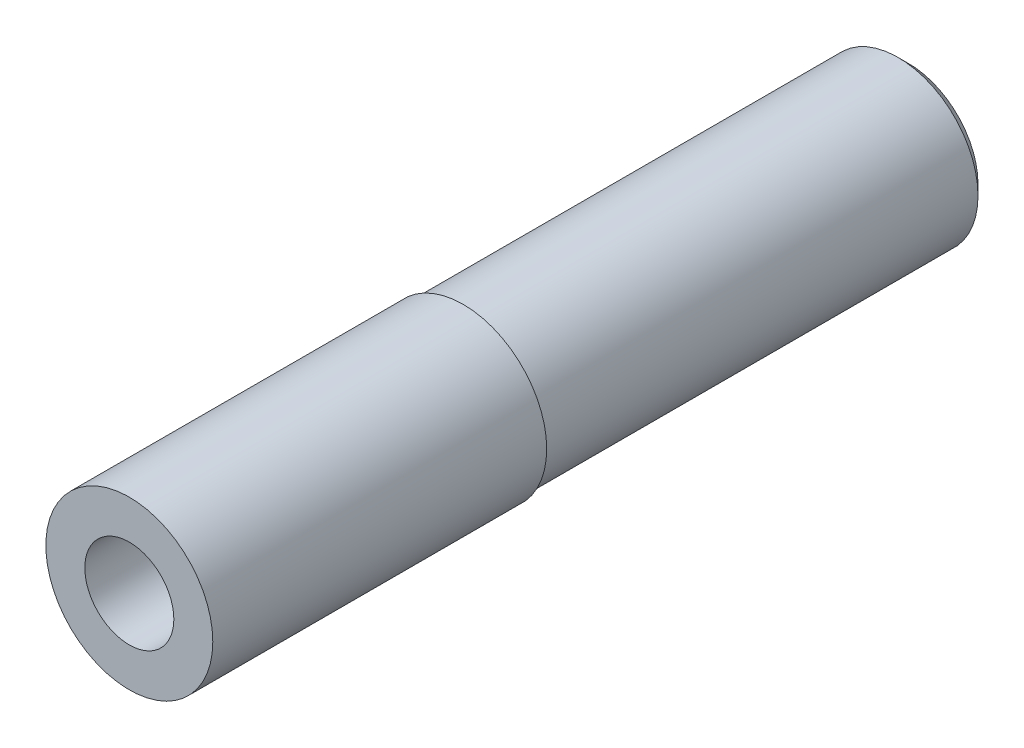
ISO-10303-21;
HEADER;
FILE_DESCRIPTION(('STEP AP214'),'2;1');
FILE_NAME('part.step','',(''),(''),'','','');
FILE_SCHEMA(('AUTOMOTIVE_DESIGN { 1 0 10303 214 1 1 1 1 }'));
ENDSEC;
DATA;
#1=APPLICATION_CONTEXT('core data for automotive mechanical design processes');
#2=APPLICATION_PROTOCOL_DEFINITION('international standard','automotive_design',2000,#1);
#3=PRODUCT_CONTEXT('',#1,'mechanical');
#4=PRODUCT('Part','Part','',(#3));
#5=PRODUCT_RELATED_PRODUCT_CATEGORY('part','',(#4));
#6=PRODUCT_DEFINITION_FORMATION('','',#4);
#7=PRODUCT_DEFINITION_CONTEXT('part definition',#1,'design');
#8=PRODUCT_DEFINITION('design','',#6,#7);
#9=PRODUCT_DEFINITION_SHAPE('','',#8);
#10=(LENGTH_UNIT() NAMED_UNIT(*) SI_UNIT(.MILLI.,.METRE.));
#11=(NAMED_UNIT(*) PLANE_ANGLE_UNIT() SI_UNIT($,.RADIAN.));
#12=(NAMED_UNIT(*) SI_UNIT($,.STERADIAN.) SOLID_ANGLE_UNIT());
#13=UNCERTAINTY_MEASURE_WITH_UNIT(LENGTH_MEASURE(1.E-05),#10,'distance_accuracy_value','');
#14=(GEOMETRIC_REPRESENTATION_CONTEXT(3) GLOBAL_UNCERTAINTY_ASSIGNED_CONTEXT((#13)) GLOBAL_UNIT_ASSIGNED_CONTEXT((#10,
#11,#12)) REPRESENTATION_CONTEXT('',''));
#15=CARTESIAN_POINT('',(0.,0.,0.));
#16=DIRECTION('',(0.,0.,1.));
#17=DIRECTION('',(1.,0.,0.));
#18=AXIS2_PLACEMENT_3D('',#15,#16,#17);
#19=CARTESIAN_POINT('',(0.,0.,3.79790950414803));
#20=DIRECTION('',(0.,0.,1.));
#21=DIRECTION('',(1.,0.,0.));
#22=AXIS2_PLACEMENT_3D('',#19,#20,#21);
#23=CYLINDRICAL_SURFACE('',#22,0.599999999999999);
#24=CARTESIAN_POINT('',(0.,0.,-11.));
#25=DIRECTION('',(0.,0.,1.));
#26=DIRECTION('',(1.,0.,0.));
#27=AXIS2_PLACEMENT_3D('',#24,#25,#26);
#28=CIRCLE('',#27,0.6);
#29=CARTESIAN_POINT('',(0.6,0.,-11.));
#30=VERTEX_POINT('',#29);
#31=EDGE_CURVE('E186',#30,#30,#28,.T.);
#32=ORIENTED_EDGE('',*,*,#31,.F.);
#33=EDGE_LOOP('',(#32));
#34=FACE_BOUND('',#33,.T.);
#35=CARTESIAN_POINT('',(0.,0.,-3.6));
#36=DIRECTION('',(0.,0.,1.));
#37=DIRECTION('',(1.,0.,0.));
#38=AXIS2_PLACEMENT_3D('',#35,#36,#37);
#39=CIRCLE('',#38,0.599999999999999);
#40=CARTESIAN_POINT('',(0.519615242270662,-0.299999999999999,-3.6));
#41=VERTEX_POINT('',#40);
#42=CARTESIAN_POINT('',(0.,-0.599999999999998,-3.6));
#43=VERTEX_POINT('',#42);
#44=EDGE_CURVE('E11',#41,#43,#39,.F.);
#45=ORIENTED_EDGE('',*,*,#44,.F.);
#46=CARTESIAN_POINT('',(0.519615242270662,0.299999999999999,-3.6));
#47=VERTEX_POINT('',#46);
#48=EDGE_CURVE('E39',#47,#41,#39,.F.);
#49=ORIENTED_EDGE('',*,*,#48,.F.);
#50=CARTESIAN_POINT('',(0.,0.599999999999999,-3.6));
#51=VERTEX_POINT('',#50);
#52=EDGE_CURVE('E112',#51,#47,#39,.F.);
#53=ORIENTED_EDGE('',*,*,#52,.F.);
#54=CARTESIAN_POINT('',(-0.519615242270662,0.299999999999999,-3.6));
#55=VERTEX_POINT('',#54);
#56=EDGE_CURVE('E297',#55,#51,#39,.F.);
#57=ORIENTED_EDGE('',*,*,#56,.F.);
#58=CARTESIAN_POINT('',(-0.519615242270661,-0.299999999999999,-3.6));
#59=VERTEX_POINT('',#58);
#60=EDGE_CURVE('E295',#59,#55,#39,.F.);
#61=ORIENTED_EDGE('',*,*,#60,.F.);
#62=EDGE_CURVE('E44',#43,#59,#39,.F.);
#63=ORIENTED_EDGE('',*,*,#62,.F.);
#64=EDGE_LOOP('',(#45,#49,#53,#57,#61,#63));
#65=FACE_BOUND('',#64,.T.);
#66=ADVANCED_FACE('F35',(#34,#65),#23,.F.);
#67=CARTESIAN_POINT('',(0.,0.,3.79790950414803));
#68=DIRECTION('',(0.,0.,1.));
#69=DIRECTION('',(1.,0.,0.));
#70=AXIS2_PLACEMENT_3D('',#67,#68,#69);
#71=CYLINDRICAL_SURFACE('',#70,1.5);
#72=CARTESIAN_POINT('',(0.,0.,0.));
#73=DIRECTION('',(0.,0.,1.));
#74=DIRECTION('',(1.,0.,0.));
#75=AXIS2_PLACEMENT_3D('',#72,#73,#74);
#76=CIRCLE('',#75,1.5);
#77=CARTESIAN_POINT('',(1.5,0.,0.));
#78=VERTEX_POINT('',#77);
#79=EDGE_CURVE('E195',#78,#78,#76,.T.);
#80=ORIENTED_EDGE('',*,*,#79,.F.);
#81=EDGE_LOOP('',(#80));
#82=FACE_BOUND('',#81,.T.);
#83=CARTESIAN_POINT('',(0.,0.,-6.));
#84=DIRECTION('',(0.,0.,-1.));
#85=DIRECTION('',(-1.,0.,0.));
#86=AXIS2_PLACEMENT_3D('',#83,#84,#85);
#87=CIRCLE('',#86,1.5);
#88=CARTESIAN_POINT('',(-1.5,0.,-6.));
#89=VERTEX_POINT('',#88);
#90=EDGE_CURVE('E180',#89,#89,#87,.T.);
#91=ORIENTED_EDGE('',*,*,#90,.F.);
#92=EDGE_LOOP('',(#91));
#93=FACE_BOUND('',#92,.T.);
#94=ADVANCED_FACE('F37',(#82,#93),#71,.T.);
#95=CARTESIAN_POINT('',(0.,0.,-14.));
#96=DIRECTION('',(0.,0.,1.));
#97=DIRECTION('',(1.,0.,0.));
#98=AXIS2_PLACEMENT_3D('',#95,#96,#97);
#99=CONICAL_SURFACE('',#98,1.2499999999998,0.785398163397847);
#100=CARTESIAN_POINT('',(0.,0.,-14.));
#101=DIRECTION('',(0.,0.,1.));
#102=DIRECTION('',(1.,0.,0.));
#103=AXIS2_PLACEMENT_3D('',#100,#101,#102);
#104=CIRCLE('',#103,1.2499999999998);
#105=CARTESIAN_POINT('',(1.2499999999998,0.,-14.));
#106=VERTEX_POINT('',#105);
#107=EDGE_CURVE('E176',#106,#106,#104,.T.);
#108=ORIENTED_EDGE('',*,*,#107,.T.);
#109=EDGE_LOOP('',(#108));
#110=FACE_BOUND('',#109,.T.);
#111=CARTESIAN_POINT('',(0.,0.,-13.8149999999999));
#112=DIRECTION('',(0.,0.,1.));
#113=DIRECTION('',(1.,0.,0.));
#114=AXIS2_PLACEMENT_3D('',#111,#112,#113);
#115=CIRCLE('',#114,1.435);
#116=CARTESIAN_POINT('',(1.435,0.,-13.8149999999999));
#117=VERTEX_POINT('',#116);
#118=EDGE_CURVE('E175',#117,#117,#115,.T.);
#119=ORIENTED_EDGE('',*,*,#118,.F.);
#120=EDGE_LOOP('',(#119));
#121=FACE_BOUND('',#120,.T.);
#122=ADVANCED_FACE('F205',(#110,#121),#99,.T.);
#123=CARTESIAN_POINT('',(0.,1.5,0.));
#124=DIRECTION('',(0.,0.,-1.));
#125=DIRECTION('',(-1.,0.,0.));
#126=AXIS2_PLACEMENT_3D('',#123,#124,#125);
#127=PLANE('',#126);
#128=CARTESIAN_POINT('',(0.,0.,0.));
#129=DIRECTION('',(0.,0.,1.));
#130=DIRECTION('',(1.,0.,0.));
#131=AXIS2_PLACEMENT_3D('',#128,#129,#130);
#132=CIRCLE('',#131,0.8);
#133=CARTESIAN_POINT('',(0.8,0.,0.));
#134=VERTEX_POINT('',#133);
#135=EDGE_CURVE('E192',#134,#134,#132,.T.);
#136=ORIENTED_EDGE('',*,*,#135,.F.);
#137=EDGE_LOOP('',(#136));
#138=FACE_BOUND('',#137,.T.);
#139=ORIENTED_EDGE('',*,*,#79,.T.);
#140=EDGE_LOOP('',(#139));
#141=FACE_BOUND('',#140,.T.);
#142=ADVANCED_FACE('F211',(#138,#141),#127,.F.);
#143=CARTESIAN_POINT('',(0.,0.,3.79790950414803));
#144=DIRECTION('',(0.,0.,1.));
#145=DIRECTION('',(1.,0.,0.));
#146=AXIS2_PLACEMENT_3D('',#143,#144,#145);
#147=CYLINDRICAL_SURFACE('',#146,0.8);
#148=CARTESIAN_POINT('',(0.,0.,-2.2));
#149=DIRECTION('',(0.,0.,1.));
#150=DIRECTION('',(1.,0.,0.));
#151=AXIS2_PLACEMENT_3D('',#148,#149,#150);
#152=CIRCLE('',#151,0.8);
#153=CARTESIAN_POINT('',(0.8,0.,-2.2));
#154=VERTEX_POINT('',#153);
#155=EDGE_CURVE('E189',#154,#154,#152,.T.);
#156=ORIENTED_EDGE('',*,*,#155,.F.);
#157=EDGE_LOOP('',(#156));
#158=FACE_BOUND('',#157,.T.);
#159=ORIENTED_EDGE('',*,*,#135,.T.);
#160=EDGE_LOOP('',(#159));
#161=FACE_BOUND('',#160,.T.);
#162=ADVANCED_FACE('F219',(#158,#161),#147,.F.);
#163=CARTESIAN_POINT('',(0.,0.8,-2.2));
#164=DIRECTION('',(0.,0.,-1.));
#165=DIRECTION('',(-1.,0.,0.));
#166=AXIS2_PLACEMENT_3D('',#163,#164,#165);
#167=PLANE('',#166);
#168=DIRECTION('',(-1.,0.,0.));
#169=VECTOR('',#168,1.);
#170=CARTESIAN_POINT('',(0.346410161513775,0.599999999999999,-2.2));
#171=LINE('',#170,#169);
#172=CARTESIAN_POINT('',(0.346410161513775,0.599999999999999,-2.2));
#173=VERTEX_POINT('',#172);
#174=CARTESIAN_POINT('',(-0.346410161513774,0.599999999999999,-2.2));
#175=VERTEX_POINT('',#174);
#176=EDGE_CURVE('E51',#173,#175,#171,.T.);
#177=ORIENTED_EDGE('',*,*,#176,.F.);
#178=DIRECTION('',(-0.5,0.866025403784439,0.));
#179=VECTOR('',#178,1.);
#180=CARTESIAN_POINT('',(0.692820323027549,0.,-2.2));
#181=LINE('',#180,#179);
#182=CARTESIAN_POINT('',(0.692820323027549,0.,-2.2));
#183=VERTEX_POINT('',#182);
#184=EDGE_CURVE('E121',#183,#173,#181,.T.);
#185=ORIENTED_EDGE('',*,*,#184,.F.);
#186=DIRECTION('',(0.5,0.866025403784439,0.));
#187=VECTOR('',#186,1.);
#188=CARTESIAN_POINT('',(0.346410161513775,-0.599999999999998,-2.2));
#189=LINE('',#188,#187);
#190=CARTESIAN_POINT('',(0.346410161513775,-0.599999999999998,-2.2));
#191=VERTEX_POINT('',#190);
#192=EDGE_CURVE('E115',#191,#183,#189,.T.);
#193=ORIENTED_EDGE('',*,*,#192,.F.);
#194=DIRECTION('',(1.,0.,0.));
#195=VECTOR('',#194,1.);
#196=CARTESIAN_POINT('',(-0.346410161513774,-0.599999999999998,-2.2));
#197=LINE('',#196,#195);
#198=CARTESIAN_POINT('',(-0.346410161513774,-0.599999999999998,-2.2));
#199=VERTEX_POINT('',#198);
#200=EDGE_CURVE('E155',#199,#191,#197,.T.);
#201=ORIENTED_EDGE('',*,*,#200,.F.);
#202=DIRECTION('',(0.5,-0.866025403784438,0.));
#203=VECTOR('',#202,1.);
#204=CARTESIAN_POINT('',(-0.692820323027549,0.,-2.2));
#205=LINE('',#204,#203);
#206=CARTESIAN_POINT('',(-0.692820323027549,0.,-2.2));
#207=VERTEX_POINT('',#206);
#208=EDGE_CURVE('E152',#207,#199,#205,.T.);
#209=ORIENTED_EDGE('',*,*,#208,.F.);
#210=DIRECTION('',(-0.5,-0.866025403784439,0.));
#211=VECTOR('',#210,1.);
#212=CARTESIAN_POINT('',(-0.346410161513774,0.599999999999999,-2.2));
#213=LINE('',#212,#211);
#214=EDGE_CURVE('E149',#175,#207,#213,.T.);
#215=ORIENTED_EDGE('',*,*,#214,.F.);
#216=EDGE_LOOP('',(#177,#185,#193,#201,#209,#215));
#217=FACE_BOUND('',#216,.T.);
#218=ORIENTED_EDGE('',*,*,#155,.T.);
#219=EDGE_LOOP('',(#218));
#220=FACE_BOUND('',#219,.T.);
#221=ADVANCED_FACE('F224',(#217,#220),#167,.F.);
#222=CARTESIAN_POINT('',(0.,0.6,-11.));
#223=DIRECTION('',(0.,0.,1.));
#224=DIRECTION('',(1.,0.,0.));
#225=AXIS2_PLACEMENT_3D('',#222,#223,#224);
#226=PLANE('',#225);
#227=CARTESIAN_POINT('',(0.,0.,-11.));
#228=DIRECTION('',(0.,0.,1.));
#229=DIRECTION('',(1.,0.,0.));
#230=AXIS2_PLACEMENT_3D('',#227,#228,#229);
#231=CIRCLE('',#230,1.);
#232=CARTESIAN_POINT('',(1.,0.,-11.));
#233=VERTEX_POINT('',#232);
#234=EDGE_CURVE('E183',#233,#233,#231,.T.);
#235=ORIENTED_EDGE('',*,*,#234,.F.);
#236=EDGE_LOOP('',(#235));
#237=FACE_BOUND('',#236,.T.);
#238=ORIENTED_EDGE('',*,*,#31,.T.);
#239=EDGE_LOOP('',(#238));
#240=FACE_BOUND('',#239,.T.);
#241=ADVANCED_FACE('F230',(#237,#240),#226,.F.);
#242=CARTESIAN_POINT('',(0.,0.,3.79790950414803));
#243=DIRECTION('',(0.,0.,1.));
#244=DIRECTION('',(1.,0.,0.));
#245=AXIS2_PLACEMENT_3D('',#242,#243,#244);
#246=CYLINDRICAL_SURFACE('',#245,1.);
#247=CARTESIAN_POINT('',(0.,0.,-14.));
#248=DIRECTION('',(0.,0.,1.));
#249=DIRECTION('',(1.,0.,0.));
#250=AXIS2_PLACEMENT_3D('',#247,#248,#249);
#251=CIRCLE('',#250,1.);
#252=CARTESIAN_POINT('',(1.,0.,-14.));
#253=VERTEX_POINT('',#252);
#254=EDGE_CURVE('E179',#253,#253,#251,.T.);
#255=ORIENTED_EDGE('',*,*,#254,.F.);
#256=EDGE_LOOP('',(#255));
#257=FACE_BOUND('',#256,.T.);
#258=ORIENTED_EDGE('',*,*,#234,.T.);
#259=EDGE_LOOP('',(#258));
#260=FACE_BOUND('',#259,.T.);
#261=ADVANCED_FACE('F234',(#257,#260),#246,.F.);
#262=CARTESIAN_POINT('',(0.,1.,-14.));
#263=DIRECTION('',(0.,0.,1.));
#264=DIRECTION('',(1.,0.,0.));
#265=AXIS2_PLACEMENT_3D('',#262,#263,#264);
#266=PLANE('',#265);
#267=ORIENTED_EDGE('',*,*,#107,.F.);
#268=EDGE_LOOP('',(#267));
#269=FACE_BOUND('',#268,.T.);
#270=ORIENTED_EDGE('',*,*,#254,.T.);
#271=EDGE_LOOP('',(#270));
#272=FACE_BOUND('',#271,.T.);
#273=ADVANCED_FACE('F238',(#269,#272),#266,.F.);
#274=CARTESIAN_POINT('',(0.,1.435,-6.));
#275=DIRECTION('',(0.,0.,-1.));
#276=DIRECTION('',(-1.,0.,0.));
#277=AXIS2_PLACEMENT_3D('',#274,#275,#276);
#278=PLANE('',#277);
#279=CARTESIAN_POINT('',(0.,0.,-6.));
#280=DIRECTION('',(0.,0.,1.));
#281=DIRECTION('',(1.,0.,0.));
#282=AXIS2_PLACEMENT_3D('',#279,#280,#281);
#283=CIRCLE('',#282,1.435);
#284=CARTESIAN_POINT('',(1.435,0.,-6.));
#285=VERTEX_POINT('',#284);
#286=EDGE_CURVE('E161',#285,#285,#283,.T.);
#287=ORIENTED_EDGE('',*,*,#286,.T.);
#288=EDGE_LOOP('',(#287));
#289=FACE_BOUND('',#288,.T.);
#290=ORIENTED_EDGE('',*,*,#90,.T.);
#291=EDGE_LOOP('',(#290));
#292=FACE_BOUND('',#291,.T.);
#293=ADVANCED_FACE('F202',(#289,#292),#278,.T.);
#294=CARTESIAN_POINT('',(0.,0.,0.));
#295=DIRECTION('',(0.,0.,1.));
#296=DIRECTION('',(1.,0.,0.));
#297=AXIS2_PLACEMENT_3D('',#294,#295,#296);
#298=CYLINDRICAL_SURFACE('',#297,1.435);
#299=ORIENTED_EDGE('',*,*,#286,.F.);
#300=EDGE_LOOP('',(#299));
#301=FACE_BOUND('',#300,.T.);
#302=ORIENTED_EDGE('',*,*,#118,.T.);
#303=EDGE_LOOP('',(#302));
#304=FACE_BOUND('',#303,.T.);
#305=ADVANCED_FACE('F245',(#301,#304),#298,.T.);
#306=CARTESIAN_POINT('',(0.692820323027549,0.,-3.6));
#307=DIRECTION('',(0.866025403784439,0.5,0.));
#308=DIRECTION('',(-0.5,0.866025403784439,0.));
#309=AXIS2_PLACEMENT_3D('',#306,#307,#308);
#310=PLANE('',#309);
#311=ORIENTED_EDGE('',*,*,#184,.T.);
#312=DIRECTION('',(0.,0.,1.));
#313=VECTOR('',#312,1.);
#314=CARTESIAN_POINT('',(0.346410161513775,0.599999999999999,-3.6));
#315=LINE('',#314,#313);
#316=CARTESIAN_POINT('',(0.346410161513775,0.599999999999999,-3.6));
#317=VERTEX_POINT('',#316);
#318=EDGE_CURVE('E118',#317,#173,#315,.T.);
#319=ORIENTED_EDGE('',*,*,#318,.F.);
#320=DIRECTION('',(-0.5,0.866025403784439,0.));
#321=VECTOR('',#320,1.);
#322=CARTESIAN_POINT('',(0.692820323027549,0.,-3.6));
#323=LINE('',#322,#321);
#324=EDGE_CURVE('E106',#47,#317,#323,.T.);
#325=ORIENTED_EDGE('',*,*,#324,.F.);
#326=CARTESIAN_POINT('',(0.692820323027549,0.,-3.6));
#327=VERTEX_POINT('',#326);
#328=EDGE_CURVE('E59',#327,#47,#323,.T.);
#329=ORIENTED_EDGE('',*,*,#328,.F.);
#330=DIRECTION('',(0.,0.,1.));
#331=VECTOR('',#330,1.);
#332=CARTESIAN_POINT('',(0.692820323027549,0.,-3.6));
#333=LINE('',#332,#331);
#334=EDGE_CURVE('E159',#327,#183,#333,.T.);
#335=ORIENTED_EDGE('',*,*,#334,.T.);
#336=EDGE_LOOP('',(#311,#319,#325,#329,#335));
#337=FACE_BOUND('',#336,.T.);
#338=ADVANCED_FACE('F119',(#337),#310,.F.);
#339=CARTESIAN_POINT('',(0.346410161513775,-0.599999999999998,-3.6));
#340=DIRECTION('',(0.866025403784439,-0.5,0.));
#341=DIRECTION('',(0.5,0.866025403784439,0.));
#342=AXIS2_PLACEMENT_3D('',#339,#340,#341);
#343=PLANE('',#342);
#344=ORIENTED_EDGE('',*,*,#192,.T.);
#345=ORIENTED_EDGE('',*,*,#334,.F.);
#346=DIRECTION('',(0.5,0.866025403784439,0.));
#347=VECTOR('',#346,1.);
#348=CARTESIAN_POINT('',(0.346410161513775,-0.599999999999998,-3.6));
#349=LINE('',#348,#347);
#350=EDGE_CURVE('E144',#41,#327,#349,.T.);
#351=ORIENTED_EDGE('',*,*,#350,.F.);
#352=CARTESIAN_POINT('',(0.346410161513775,-0.599999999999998,-3.6));
#353=VERTEX_POINT('',#352);
#354=EDGE_CURVE('E124',#353,#41,#349,.T.);
#355=ORIENTED_EDGE('',*,*,#354,.F.);
#356=DIRECTION('',(0.,0.,1.));
#357=VECTOR('',#356,1.);
#358=CARTESIAN_POINT('',(0.346410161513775,-0.599999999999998,-3.6));
#359=LINE('',#358,#357);
#360=EDGE_CURVE('E162',#353,#191,#359,.T.);
#361=ORIENTED_EDGE('',*,*,#360,.T.);
#362=EDGE_LOOP('',(#344,#345,#351,#355,#361));
#363=FACE_BOUND('',#362,.T.);
#364=ADVANCED_FACE('F252',(#363),#343,.F.);
#365=CARTESIAN_POINT('',(-0.346410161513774,-0.599999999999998,-3.6));
#366=DIRECTION('',(0.,-1.,0.));
#367=DIRECTION('',(0.,0.,-1.));
#368=AXIS2_PLACEMENT_3D('',#365,#366,#367);
#369=PLANE('',#368);
#370=ORIENTED_EDGE('',*,*,#200,.T.);
#371=ORIENTED_EDGE('',*,*,#360,.F.);
#372=DIRECTION('',(1.,0.,0.));
#373=VECTOR('',#372,1.);
#374=CARTESIAN_POINT('',(-0.346410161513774,-0.599999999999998,-3.6));
#375=LINE('',#374,#373);
#376=EDGE_CURVE('E140',#43,#353,#375,.T.);
#377=ORIENTED_EDGE('',*,*,#376,.F.);
#378=CARTESIAN_POINT('',(-0.346410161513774,-0.599999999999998,-3.6));
#379=VERTEX_POINT('',#378);
#380=EDGE_CURVE('E141',#379,#43,#375,.T.);
#381=ORIENTED_EDGE('',*,*,#380,.F.);
#382=DIRECTION('',(0.,0.,1.));
#383=VECTOR('',#382,1.);
#384=CARTESIAN_POINT('',(-0.346410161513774,-0.599999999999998,-3.6));
#385=LINE('',#384,#383);
#386=EDGE_CURVE('E165',#379,#199,#385,.T.);
#387=ORIENTED_EDGE('',*,*,#386,.T.);
#388=EDGE_LOOP('',(#370,#371,#377,#381,#387));
#389=FACE_BOUND('',#388,.T.);
#390=ADVANCED_FACE('F263',(#389),#369,.F.);
#391=CARTESIAN_POINT('',(-0.692820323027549,0.,-3.6));
#392=DIRECTION('',(-0.866025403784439,-0.5,0.));
#393=DIRECTION('',(0.5,-0.866025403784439,0.));
#394=AXIS2_PLACEMENT_3D('',#391,#392,#393);
#395=PLANE('',#394);
#396=ORIENTED_EDGE('',*,*,#208,.T.);
#397=ORIENTED_EDGE('',*,*,#386,.F.);
#398=DIRECTION('',(0.5,-0.866025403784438,0.));
#399=VECTOR('',#398,1.);
#400=CARTESIAN_POINT('',(-0.692820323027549,0.,-3.6));
#401=LINE('',#400,#399);
#402=EDGE_CURVE('E136',#59,#379,#401,.T.);
#403=ORIENTED_EDGE('',*,*,#402,.F.);
#404=CARTESIAN_POINT('',(-0.692820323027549,0.,-3.6));
#405=VERTEX_POINT('',#404);
#406=EDGE_CURVE('E137',#405,#59,#401,.T.);
#407=ORIENTED_EDGE('',*,*,#406,.F.);
#408=DIRECTION('',(0.,0.,1.));
#409=VECTOR('',#408,1.);
#410=CARTESIAN_POINT('',(-0.692820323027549,0.,-3.6));
#411=LINE('',#410,#409);
#412=EDGE_CURVE('E168',#405,#207,#411,.T.);
#413=ORIENTED_EDGE('',*,*,#412,.T.);
#414=EDGE_LOOP('',(#396,#397,#403,#407,#413));
#415=FACE_BOUND('',#414,.T.);
#416=ADVANCED_FACE('F259',(#415),#395,.F.);
#417=CARTESIAN_POINT('',(-0.346410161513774,0.599999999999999,-3.6));
#418=DIRECTION('',(-0.866025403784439,0.5,0.));
#419=DIRECTION('',(-0.5,-0.866025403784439,0.));
#420=AXIS2_PLACEMENT_3D('',#417,#418,#419);
#421=PLANE('',#420);
#422=ORIENTED_EDGE('',*,*,#214,.T.);
#423=ORIENTED_EDGE('',*,*,#412,.F.);
#424=DIRECTION('',(-0.5,-0.866025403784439,0.));
#425=VECTOR('',#424,1.);
#426=CARTESIAN_POINT('',(-0.346410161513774,0.599999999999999,-3.6));
#427=LINE('',#426,#425);
#428=EDGE_CURVE('E130',#55,#405,#427,.T.);
#429=ORIENTED_EDGE('',*,*,#428,.F.);
#430=CARTESIAN_POINT('',(-0.346410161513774,0.599999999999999,-3.6));
#431=VERTEX_POINT('',#430);
#432=EDGE_CURVE('E132',#431,#55,#427,.T.);
#433=ORIENTED_EDGE('',*,*,#432,.F.);
#434=DIRECTION('',(0.,0.,1.));
#435=VECTOR('',#434,1.);
#436=CARTESIAN_POINT('',(-0.346410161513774,0.599999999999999,-3.6));
#437=LINE('',#436,#435);
#438=EDGE_CURVE('E123',#431,#175,#437,.T.);
#439=ORIENTED_EDGE('',*,*,#438,.T.);
#440=EDGE_LOOP('',(#422,#423,#429,#433,#439));
#441=FACE_BOUND('',#440,.T.);
#442=ADVANCED_FACE('F256',(#441),#421,.F.);
#443=CARTESIAN_POINT('',(0.346410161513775,0.599999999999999,-3.6));
#444=DIRECTION('',(0.,1.,0.));
#445=DIRECTION('',(-1.,0.,0.));
#446=AXIS2_PLACEMENT_3D('',#443,#444,#445);
#447=PLANE('',#446);
#448=ORIENTED_EDGE('',*,*,#176,.T.);
#449=ORIENTED_EDGE('',*,*,#438,.F.);
#450=DIRECTION('',(-1.,0.,0.));
#451=VECTOR('',#450,1.);
#452=CARTESIAN_POINT('',(0.346410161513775,0.599999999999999,-3.6));
#453=LINE('',#452,#451);
#454=EDGE_CURVE('E129',#51,#431,#453,.T.);
#455=ORIENTED_EDGE('',*,*,#454,.F.);
#456=EDGE_CURVE('E110',#317,#51,#453,.T.);
#457=ORIENTED_EDGE('',*,*,#456,.F.);
#458=ORIENTED_EDGE('',*,*,#318,.T.);
#459=EDGE_LOOP('',(#448,#449,#455,#457,#458));
#460=FACE_BOUND('',#459,.T.);
#461=ADVANCED_FACE('F127',(#460),#447,.F.);
#462=CARTESIAN_POINT('',(0.346410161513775,0.599999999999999,-3.6));
#463=DIRECTION('',(0.,0.,1.));
#464=DIRECTION('',(1.,0.,0.));
#465=AXIS2_PLACEMENT_3D('',#462,#463,#464);
#466=PLANE('',#465);
#467=ORIENTED_EDGE('',*,*,#44,.T.);
#468=ORIENTED_EDGE('',*,*,#376,.T.);
#469=ORIENTED_EDGE('',*,*,#354,.T.);
#470=EDGE_LOOP('',(#467,#468,#469));
#471=FACE_BOUND('',#470,.T.);
#472=ADVANCED_FACE('F255',(#471),#466,.T.);
#473=ORIENTED_EDGE('',*,*,#62,.T.);
#474=ORIENTED_EDGE('',*,*,#402,.T.);
#475=ORIENTED_EDGE('',*,*,#380,.T.);
#476=EDGE_LOOP('',(#473,#474,#475));
#477=FACE_BOUND('',#476,.T.);
#478=ADVANCED_FACE('F272',(#477),#466,.T.);
#479=ORIENTED_EDGE('',*,*,#60,.T.);
#480=ORIENTED_EDGE('',*,*,#428,.T.);
#481=ORIENTED_EDGE('',*,*,#406,.T.);
#482=EDGE_LOOP('',(#479,#480,#481));
#483=FACE_BOUND('',#482,.T.);
#484=ADVANCED_FACE('F278',(#483),#466,.T.);
#485=ORIENTED_EDGE('',*,*,#56,.T.);
#486=ORIENTED_EDGE('',*,*,#454,.T.);
#487=ORIENTED_EDGE('',*,*,#432,.T.);
#488=EDGE_LOOP('',(#485,#486,#487));
#489=FACE_BOUND('',#488,.T.);
#490=ADVANCED_FACE('F284',(#489),#466,.T.);
#491=ORIENTED_EDGE('',*,*,#52,.T.);
#492=ORIENTED_EDGE('',*,*,#324,.T.);
#493=ORIENTED_EDGE('',*,*,#456,.T.);
#494=EDGE_LOOP('',(#491,#492,#493));
#495=FACE_BOUND('',#494,.T.);
#496=ADVANCED_FACE('F108',(#495),#466,.T.);
#497=ORIENTED_EDGE('',*,*,#48,.T.);
#498=ORIENTED_EDGE('',*,*,#350,.T.);
#499=ORIENTED_EDGE('',*,*,#328,.T.);
#500=EDGE_LOOP('',(#497,#498,#499));
#501=FACE_BOUND('',#500,.T.);
#502=ADVANCED_FACE('F274',(#501),#466,.T.);
#503=CLOSED_SHELL('',(#66,#94,#122,#142,#162,#221,#241,#261,#273,#293,#305,#338,#364,#390,#416,
#442,#461,#472,#478,#484,#490,#496,#502));
#504=MANIFOLD_SOLID_BREP('B2',#503);
#505=ADVANCED_BREP_SHAPE_REPRESENTATION('',(#18,#504),#14);
#506=SHAPE_DEFINITION_REPRESENTATION(#9,#505);
ENDSEC;
END-ISO-10303-21;
